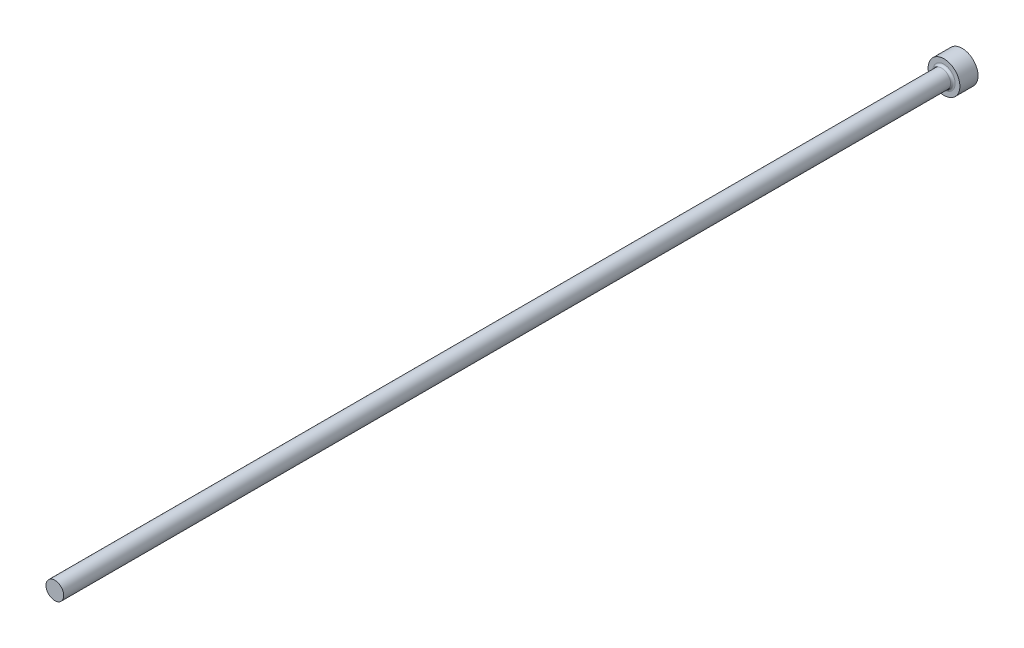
ISO-10303-21;
HEADER;
FILE_DESCRIPTION(('STEP AP214'),'2;1');
FILE_NAME('part.step','',(''),(''),'','','');
FILE_SCHEMA(('AUTOMOTIVE_DESIGN { 1 0 10303 214 1 1 1 1 }'));
ENDSEC;
DATA;
#1=APPLICATION_CONTEXT('core data for automotive mechanical design processes');
#2=APPLICATION_PROTOCOL_DEFINITION('international standard','automotive_design',2000,#1);
#3=PRODUCT_CONTEXT('',#1,'mechanical');
#4=PRODUCT('Part','Part','',(#3));
#5=PRODUCT_RELATED_PRODUCT_CATEGORY('part','',(#4));
#6=PRODUCT_DEFINITION_FORMATION('','',#4);
#7=PRODUCT_DEFINITION_CONTEXT('part definition',#1,'design');
#8=PRODUCT_DEFINITION('design','',#6,#7);
#9=PRODUCT_DEFINITION_SHAPE('','',#8);
#10=(LENGTH_UNIT() NAMED_UNIT(*) SI_UNIT(.MILLI.,.METRE.));
#11=(NAMED_UNIT(*) PLANE_ANGLE_UNIT() SI_UNIT($,.RADIAN.));
#12=(NAMED_UNIT(*) SI_UNIT($,.STERADIAN.) SOLID_ANGLE_UNIT());
#13=UNCERTAINTY_MEASURE_WITH_UNIT(LENGTH_MEASURE(1.E-05),#10,'distance_accuracy_value','');
#14=(GEOMETRIC_REPRESENTATION_CONTEXT(3) GLOBAL_UNCERTAINTY_ASSIGNED_CONTEXT((#13)) GLOBAL_UNIT_ASSIGNED_CONTEXT((#10,
#11,#12)) REPRESENTATION_CONTEXT('',''));
#15=CARTESIAN_POINT('',(0.,0.,0.));
#16=DIRECTION('',(0.,0.,1.));
#17=DIRECTION('',(1.,0.,0.));
#18=AXIS2_PLACEMENT_3D('',#15,#16,#17);
#19=CARTESIAN_POINT('',(3.5,0.,4.));
#20=DIRECTION('',(0.,0.,-1.));
#21=DIRECTION('',(-1.,0.,0.));
#22=AXIS2_PLACEMENT_3D('',#19,#20,#21);
#23=PLANE('',#22);
#24=CARTESIAN_POINT('',(0.,0.,4.));
#25=DIRECTION('',(0.,0.,-1.));
#26=DIRECTION('',(-1.,0.,0.));
#27=AXIS2_PLACEMENT_3D('',#24,#25,#26);
#28=CIRCLE('',#27,2.45000000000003);
#29=CARTESIAN_POINT('',(-2.45000000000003,0.,4.));
#30=VERTEX_POINT('',#29);
#31=EDGE_CURVE('E40',#30,#30,#28,.T.);
#32=ORIENTED_EDGE('',*,*,#31,.T.);
#33=EDGE_LOOP('',(#32));
#34=FACE_BOUND('',#33,.T.);
#35=CARTESIAN_POINT('',(0.,0.,4.));
#36=DIRECTION('',(0.,0.,-1.));
#37=DIRECTION('',(-1.,0.,0.));
#38=AXIS2_PLACEMENT_3D('',#35,#36,#37);
#39=CIRCLE('',#38,3.5);
#40=CARTESIAN_POINT('',(-3.5,0.,4.));
#41=VERTEX_POINT('',#40);
#42=EDGE_CURVE('E44',#41,#41,#39,.T.);
#43=ORIENTED_EDGE('',*,*,#42,.F.);
#44=EDGE_LOOP('',(#43));
#45=FACE_BOUND('',#44,.T.);
#46=ADVANCED_FACE('F33',(#34,#45),#23,.F.);
#47=CARTESIAN_POINT('',(0.,0.,-9.03322817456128));
#48=DIRECTION('',(0.,0.,-1.));
#49=DIRECTION('',(-1.,0.,0.));
#50=AXIS2_PLACEMENT_3D('',#47,#48,#49);
#51=CYLINDRICAL_SURFACE('',#50,3.5);
#52=CARTESIAN_POINT('',(0.,0.,0.));
#53=DIRECTION('',(0.,0.,-1.));
#54=DIRECTION('',(-1.,0.,0.));
#55=AXIS2_PLACEMENT_3D('',#52,#53,#54);
#56=CIRCLE('',#55,3.5);
#57=CARTESIAN_POINT('',(-3.5,0.,0.));
#58=VERTEX_POINT('',#57);
#59=EDGE_CURVE('E48',#58,#58,#56,.T.);
#60=ORIENTED_EDGE('',*,*,#59,.F.);
#61=EDGE_LOOP('',(#60));
#62=FACE_BOUND('',#61,.T.);
#63=ORIENTED_EDGE('',*,*,#42,.T.);
#64=EDGE_LOOP('',(#63));
#65=FACE_BOUND('',#64,.T.);
#66=ADVANCED_FACE('F68',(#62,#65),#51,.T.);
#67=CARTESIAN_POINT('',(0.,0.,0.));
#68=DIRECTION('',(0.,0.,1.));
#69=DIRECTION('',(1.,0.,0.));
#70=AXIS2_PLACEMENT_3D('',#67,#68,#69);
#71=PLANE('',#70);
#72=ORIENTED_EDGE('',*,*,#59,.T.);
#73=EDGE_LOOP('',(#72));
#74=FACE_BOUND('',#73,.T.);
#75=ADVANCED_FACE('F61',(#74),#71,.F.);
#76=CARTESIAN_POINT('',(0.,0.,200.));
#77=DIRECTION('',(0.,0.,-1.));
#78=DIRECTION('',(-1.,0.,0.));
#79=AXIS2_PLACEMENT_3D('',#76,#77,#78);
#80=PLANE('',#79);
#81=CARTESIAN_POINT('',(0.,0.,200.));
#82=DIRECTION('',(0.,0.,-1.));
#83=DIRECTION('',(-1.,0.,0.));
#84=AXIS2_PLACEMENT_3D('',#81,#82,#83);
#85=CIRCLE('',#84,1.95000000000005);
#86=CARTESIAN_POINT('',(-1.95000000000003,0.,200.));
#87=VERTEX_POINT('',#86);
#88=EDGE_CURVE('E53',#87,#87,#85,.T.);
#89=ORIENTED_EDGE('',*,*,#88,.F.);
#90=EDGE_LOOP('',(#89));
#91=FACE_BOUND('',#90,.T.);
#92=ADVANCED_FACE('F59',(#91),#80,.F.);
#93=CARTESIAN_POINT('',(0.,0.,-9.03322817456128));
#94=DIRECTION('',(0.,0.,-1.));
#95=DIRECTION('',(-1.,0.,0.));
#96=AXIS2_PLACEMENT_3D('',#93,#94,#95);
#97=CYLINDRICAL_SURFACE('',#96,1.95000000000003);
#98=CARTESIAN_POINT('',(0.,0.,4.5));
#99=DIRECTION('',(0.,0.,-1.));
#100=DIRECTION('',(-1.,0.,0.));
#101=AXIS2_PLACEMENT_3D('',#98,#99,#100);
#102=CIRCLE('',#101,1.95000000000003);
#103=CARTESIAN_POINT('',(-1.95000000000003,0.,4.5));
#104=VERTEX_POINT('',#103);
#105=EDGE_CURVE('E10',#104,#104,#102,.F.);
#106=ORIENTED_EDGE('',*,*,#105,.T.);
#107=EDGE_LOOP('',(#106));
#108=FACE_BOUND('',#107,.T.);
#109=ORIENTED_EDGE('',*,*,#88,.T.);
#110=EDGE_LOOP('',(#109));
#111=FACE_BOUND('',#110,.T.);
#112=ADVANCED_FACE('F57',(#108,#111),#97,.T.);
#113=CARTESIAN_POINT('',(0.,0.,4.5));
#114=DIRECTION('',(0.,0.,-1.));
#115=DIRECTION('',(-1.,0.,0.));
#116=AXIS2_PLACEMENT_3D('',#113,#114,#115);
#117=TOROIDAL_SURFACE('',#116,2.45000000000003,0.5);
#118=ORIENTED_EDGE('',*,*,#105,.F.);
#119=EDGE_LOOP('',(#118));
#120=FACE_BOUND('',#119,.T.);
#121=ORIENTED_EDGE('',*,*,#31,.F.);
#122=EDGE_LOOP('',(#121));
#123=FACE_BOUND('',#122,.T.);
#124=ADVANCED_FACE('F35',(#120,#123),#117,.F.);
#125=CLOSED_SHELL('',(#46,#66,#75,#92,#112,#124));
#126=MANIFOLD_SOLID_BREP('B2',#125);
#127=ADVANCED_BREP_SHAPE_REPRESENTATION('',(#18,#126),#14);
#128=SHAPE_DEFINITION_REPRESENTATION(#9,#127);
ENDSEC;
END-ISO-10303-21;
